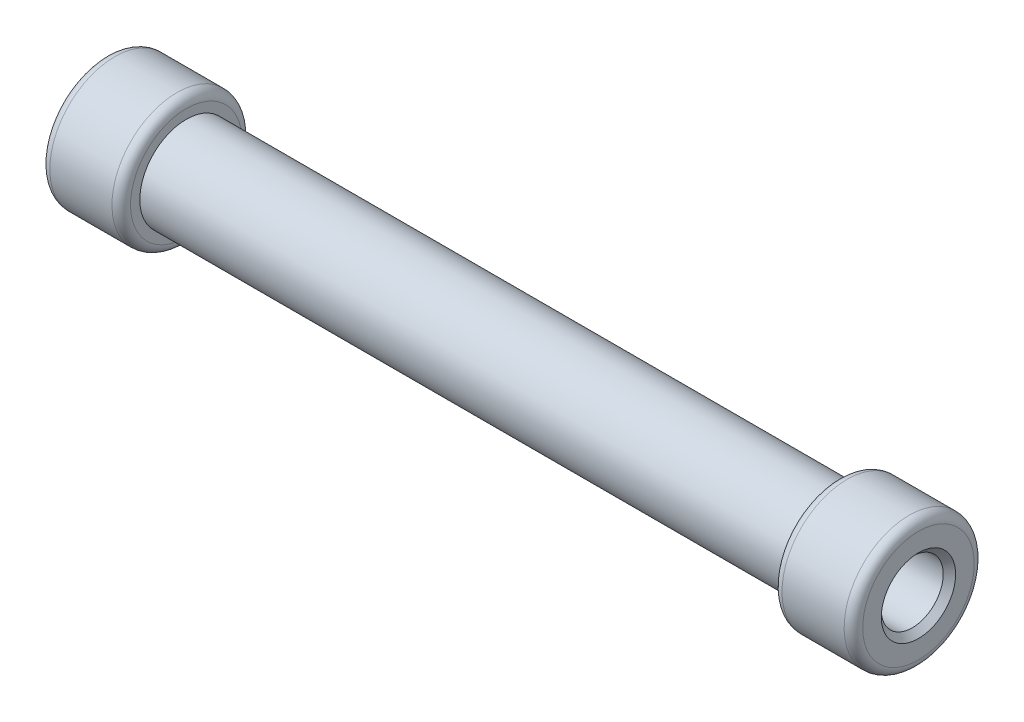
ISO-10303-21;
HEADER;
FILE_DESCRIPTION(('STEP AP214'),'2;1');
FILE_NAME('part.step','',(''),(''),'','','');
FILE_SCHEMA(('AUTOMOTIVE_DESIGN { 1 0 10303 214 1 1 1 1 }'));
ENDSEC;
DATA;
#1=APPLICATION_CONTEXT('core data for automotive mechanical design processes');
#2=APPLICATION_PROTOCOL_DEFINITION('international standard','automotive_design',2000,#1);
#3=PRODUCT_CONTEXT('',#1,'mechanical');
#4=PRODUCT('Part','Part','',(#3));
#5=PRODUCT_RELATED_PRODUCT_CATEGORY('part','',(#4));
#6=PRODUCT_DEFINITION_FORMATION('','',#4);
#7=PRODUCT_DEFINITION_CONTEXT('part definition',#1,'design');
#8=PRODUCT_DEFINITION('design','',#6,#7);
#9=PRODUCT_DEFINITION_SHAPE('','',#8);
#10=(LENGTH_UNIT() NAMED_UNIT(*) SI_UNIT(.MILLI.,.METRE.));
#11=(NAMED_UNIT(*) PLANE_ANGLE_UNIT() SI_UNIT($,.RADIAN.));
#12=(NAMED_UNIT(*) SI_UNIT($,.STERADIAN.) SOLID_ANGLE_UNIT());
#13=UNCERTAINTY_MEASURE_WITH_UNIT(LENGTH_MEASURE(1.E-05),#10,'distance_accuracy_value','');
#14=(GEOMETRIC_REPRESENTATION_CONTEXT(3) GLOBAL_UNCERTAINTY_ASSIGNED_CONTEXT((#13)) GLOBAL_UNIT_ASSIGNED_CONTEXT((#10,
#11,#12)) REPRESENTATION_CONTEXT('',''));
#15=CARTESIAN_POINT('',(0.,0.,0.));
#16=DIRECTION('',(0.,0.,1.));
#17=DIRECTION('',(1.,0.,0.));
#18=AXIS2_PLACEMENT_3D('',#15,#16,#17);
#19=CARTESIAN_POINT('',(56.1,0.,5.333333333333));
#20=DIRECTION('',(-1.,0.,0.));
#21=DIRECTION('',(0.,-1.,0.));
#22=AXIS2_PLACEMENT_3D('',#19,#20,#21);
#23=PLANE('',#22);
#24=CARTESIAN_POINT('',(56.1,0.,0.));
#25=DIRECTION('',(1.,0.,0.));
#26=DIRECTION('',(0.,1.,0.));
#27=AXIS2_PLACEMENT_3D('',#24,#25,#26);
#28=CIRCLE('',#27,5.33333333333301);
#29=CARTESIAN_POINT('',(56.1,5.33333333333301,0.));
#30=VERTEX_POINT('',#29);
#31=EDGE_CURVE('E65',#30,#30,#28,.T.);
#32=ORIENTED_EDGE('',*,*,#31,.T.);
#33=EDGE_LOOP('',(#32));
#34=FACE_BOUND('',#33,.T.);
#35=ADVANCED_FACE('F12',(#34),#23,.F.);
#36=CARTESIAN_POINT('',(70.,0.,0.));
#37=DIRECTION('',(1.,0.,0.));
#38=DIRECTION('',(0.,1.,0.));
#39=AXIS2_PLACEMENT_3D('',#36,#37,#38);
#40=CYLINDRICAL_SURFACE('',#39,5.33333333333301);
#41=ORIENTED_EDGE('',*,*,#31,.F.);
#42=EDGE_LOOP('',(#41));
#43=FACE_BOUND('',#42,.T.);
#44=CARTESIAN_POINT('',(68.93333333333,0.,0.));
#45=DIRECTION('',(1.,0.,0.));
#46=DIRECTION('',(0.,1.,0.));
#47=AXIS2_PLACEMENT_3D('',#44,#45,#46);
#48=CIRCLE('',#47,5.33333333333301);
#49=CARTESIAN_POINT('',(68.93333333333,5.33333333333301,0.));
#50=VERTEX_POINT('',#49);
#51=EDGE_CURVE('E62',#50,#50,#48,.T.);
#52=ORIENTED_EDGE('',*,*,#51,.T.);
#53=EDGE_LOOP('',(#52));
#54=FACE_BOUND('',#53,.T.);
#55=ADVANCED_FACE('F70',(#43,#54),#40,.F.);
#56=CARTESIAN_POINT('',(70.,0.,0.));
#57=DIRECTION('',(1.,0.,0.));
#58=DIRECTION('',(0.,1.,0.));
#59=AXIS2_PLACEMENT_3D('',#56,#57,#58);
#60=CONICAL_SURFACE('',#59,6.4,0.785398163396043);
#61=ORIENTED_EDGE('',*,*,#51,.F.);
#62=EDGE_LOOP('',(#61));
#63=FACE_BOUND('',#62,.T.);
#64=CARTESIAN_POINT('',(70.,0.,0.));
#65=DIRECTION('',(1.,0.,0.));
#66=DIRECTION('',(0.,1.,0.));
#67=AXIS2_PLACEMENT_3D('',#64,#65,#66);
#68=CIRCLE('',#67,6.4);
#69=CARTESIAN_POINT('',(70.,6.4,0.));
#70=VERTEX_POINT('',#69);
#71=EDGE_CURVE('E59',#70,#70,#68,.T.);
#72=ORIENTED_EDGE('',*,*,#71,.T.);
#73=EDGE_LOOP('',(#72));
#74=FACE_BOUND('',#73,.T.);
#75=ADVANCED_FACE('F73',(#63,#74),#60,.F.);
#76=CARTESIAN_POINT('',(70.,0.,9.6));
#77=DIRECTION('',(-1.,0.,0.));
#78=DIRECTION('',(0.,-1.,0.));
#79=AXIS2_PLACEMENT_3D('',#76,#77,#78);
#80=PLANE('',#79);
#81=ORIENTED_EDGE('',*,*,#71,.F.);
#82=EDGE_LOOP('',(#81));
#83=FACE_BOUND('',#82,.T.);
#84=CARTESIAN_POINT('',(70.,0.,0.));
#85=DIRECTION('',(1.,0.,0.));
#86=DIRECTION('',(0.,1.,0.));
#87=AXIS2_PLACEMENT_3D('',#84,#85,#86);
#88=CIRCLE('',#87,9.60000000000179);
#89=CARTESIAN_POINT('',(70.,9.60000000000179,0.));
#90=VERTEX_POINT('',#89);
#91=EDGE_CURVE('E56',#90,#90,#88,.T.);
#92=ORIENTED_EDGE('',*,*,#91,.T.);
#93=EDGE_LOOP('',(#92));
#94=FACE_BOUND('',#93,.T.);
#95=ADVANCED_FACE('F79',(#83,#94),#80,.F.);
#96=CARTESIAN_POINT('',(68.4000000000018,0.,0.));
#97=DIRECTION('',(1.,0.,0.));
#98=DIRECTION('',(0.,1.,0.));
#99=AXIS2_PLACEMENT_3D('',#96,#97,#98);
#100=TOROIDAL_SURFACE('',#99,9.60000000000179,1.59999999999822);
#101=CARTESIAN_POINT('',(68.4,0.,0.));
#102=DIRECTION('',(1.,0.,0.));
#103=DIRECTION('',(0.,1.,0.));
#104=AXIS2_PLACEMENT_3D('',#101,#102,#103);
#105=CIRCLE('',#104,11.2);
#106=CARTESIAN_POINT('',(68.4,11.2,0.));
#107=VERTEX_POINT('',#106);
#108=EDGE_CURVE('E53',#107,#107,#105,.T.);
#109=ORIENTED_EDGE('',*,*,#108,.T.);
#110=EDGE_LOOP('',(#109));
#111=FACE_BOUND('',#110,.T.);
#112=ORIENTED_EDGE('',*,*,#91,.F.);
#113=EDGE_LOOP('',(#112));
#114=FACE_BOUND('',#113,.T.);
#115=ADVANCED_FACE('F85',(#111,#114),#100,.T.);
#116=CARTESIAN_POINT('',(70.,0.,0.));
#117=DIRECTION('',(1.,0.,0.));
#118=DIRECTION('',(0.,1.,0.));
#119=AXIS2_PLACEMENT_3D('',#116,#117,#118);
#120=CYLINDRICAL_SURFACE('',#119,11.2);
#121=ORIENTED_EDGE('',*,*,#108,.F.);
#122=EDGE_LOOP('',(#121));
#123=FACE_BOUND('',#122,.T.);
#124=CARTESIAN_POINT('',(57.7000000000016,0.,0.));
#125=DIRECTION('',(1.,0.,0.));
#126=DIRECTION('',(0.,1.,0.));
#127=AXIS2_PLACEMENT_3D('',#124,#125,#126);
#128=CIRCLE('',#127,11.2);
#129=CARTESIAN_POINT('',(57.7000000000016,11.2,0.));
#130=VERTEX_POINT('',#129);
#131=EDGE_CURVE('E50',#130,#130,#128,.T.);
#132=ORIENTED_EDGE('',*,*,#131,.T.);
#133=EDGE_LOOP('',(#132));
#134=FACE_BOUND('',#133,.T.);
#135=ADVANCED_FACE('F90',(#123,#134),#120,.T.);
#136=CARTESIAN_POINT('',(57.7000000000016,0.,0.));
#137=DIRECTION('',(1.,0.,0.));
#138=DIRECTION('',(0.,1.,0.));
#139=AXIS2_PLACEMENT_3D('',#136,#137,#138);
#140=TOROIDAL_SURFACE('',#139,9.5999999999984,1.6000000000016);
#141=CARTESIAN_POINT('',(56.1,0.,0.));
#142=DIRECTION('',(1.,0.,0.));
#143=DIRECTION('',(0.,1.,0.));
#144=AXIS2_PLACEMENT_3D('',#141,#142,#143);
#145=CIRCLE('',#144,9.6);
#146=CARTESIAN_POINT('',(56.1,9.6,0.));
#147=VERTEX_POINT('',#146);
#148=EDGE_CURVE('E47',#147,#147,#145,.T.);
#149=ORIENTED_EDGE('',*,*,#148,.T.);
#150=EDGE_LOOP('',(#149));
#151=FACE_BOUND('',#150,.T.);
#152=ORIENTED_EDGE('',*,*,#131,.F.);
#153=EDGE_LOOP('',(#152));
#154=FACE_BOUND('',#153,.T.);
#155=ADVANCED_FACE('F98',(#151,#154),#140,.T.);
#156=CARTESIAN_POINT('',(56.1,0.,8.));
#157=DIRECTION('',(1.,0.,0.));
#158=DIRECTION('',(0.,1.,0.));
#159=AXIS2_PLACEMENT_3D('',#156,#157,#158);
#160=PLANE('',#159);
#161=ORIENTED_EDGE('',*,*,#148,.F.);
#162=EDGE_LOOP('',(#161));
#163=FACE_BOUND('',#162,.T.);
#164=CARTESIAN_POINT('',(56.1,0.,0.));
#165=DIRECTION('',(1.,0.,0.));
#166=DIRECTION('',(0.,1.,0.));
#167=AXIS2_PLACEMENT_3D('',#164,#165,#166);
#168=CIRCLE('',#167,8.);
#169=CARTESIAN_POINT('',(56.1,8.,0.));
#170=VERTEX_POINT('',#169);
#171=EDGE_CURVE('E44',#170,#170,#168,.T.);
#172=ORIENTED_EDGE('',*,*,#171,.T.);
#173=EDGE_LOOP('',(#172));
#174=FACE_BOUND('',#173,.T.);
#175=ADVANCED_FACE('F145',(#163,#174),#160,.F.);
#176=CARTESIAN_POINT('',(-56.1,0.,0.));
#177=DIRECTION('',(1.,0.,0.));
#178=DIRECTION('',(0.,1.,0.));
#179=AXIS2_PLACEMENT_3D('',#176,#177,#178);
#180=PLANE('',#179);
#181=CARTESIAN_POINT('',(-56.1,0.,0.));
#182=DIRECTION('',(1.,0.,0.));
#183=DIRECTION('',(0.,1.,0.));
#184=AXIS2_PLACEMENT_3D('',#181,#182,#183);
#185=CIRCLE('',#184,5.33333333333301);
#186=CARTESIAN_POINT('',(-56.1,5.33333333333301,0.));
#187=VERTEX_POINT('',#186);
#188=EDGE_CURVE('E8',#187,#187,#185,.T.);
#189=ORIENTED_EDGE('',*,*,#188,.F.);
#190=EDGE_LOOP('',(#189));
#191=FACE_BOUND('',#190,.T.);
#192=ADVANCED_FACE('F14',(#191),#180,.F.);
#193=CARTESIAN_POINT('',(70.,0.,0.));
#194=DIRECTION('',(1.,0.,0.));
#195=DIRECTION('',(0.,1.,0.));
#196=AXIS2_PLACEMENT_3D('',#193,#194,#195);
#197=CYLINDRICAL_SURFACE('',#196,5.33333333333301);
#198=CARTESIAN_POINT('',(-68.933333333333,0.,0.));
#199=DIRECTION('',(1.,0.,0.));
#200=DIRECTION('',(0.,1.,0.));
#201=AXIS2_PLACEMENT_3D('',#198,#199,#200);
#202=CIRCLE('',#201,5.33333333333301);
#203=CARTESIAN_POINT('',(-68.933333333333,5.33333333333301,0.));
#204=VERTEX_POINT('',#203);
#205=EDGE_CURVE('E19',#204,#204,#202,.T.);
#206=ORIENTED_EDGE('',*,*,#205,.F.);
#207=EDGE_LOOP('',(#206));
#208=FACE_BOUND('',#207,.T.);
#209=ORIENTED_EDGE('',*,*,#188,.T.);
#210=EDGE_LOOP('',(#209));
#211=FACE_BOUND('',#210,.T.);
#212=ADVANCED_FACE('F161',(#208,#211),#197,.F.);
#213=CARTESIAN_POINT('',(-68.933333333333,0.,0.));
#214=DIRECTION('',(-1.,0.,0.));
#215=DIRECTION('',(0.,-1.,0.));
#216=AXIS2_PLACEMENT_3D('',#213,#214,#215);
#217=CONICAL_SURFACE('',#216,5.33333333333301,0.785398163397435);
#218=CARTESIAN_POINT('',(-70.,0.,0.));
#219=DIRECTION('',(1.,0.,0.));
#220=DIRECTION('',(0.,1.,0.));
#221=AXIS2_PLACEMENT_3D('',#218,#219,#220);
#222=CIRCLE('',#221,6.4);
#223=CARTESIAN_POINT('',(-70.,6.4,0.));
#224=VERTEX_POINT('',#223);
#225=EDGE_CURVE('E23',#224,#224,#222,.T.);
#226=ORIENTED_EDGE('',*,*,#225,.F.);
#227=EDGE_LOOP('',(#226));
#228=FACE_BOUND('',#227,.T.);
#229=ORIENTED_EDGE('',*,*,#205,.T.);
#230=EDGE_LOOP('',(#229));
#231=FACE_BOUND('',#230,.T.);
#232=ADVANCED_FACE('F169',(#228,#231),#217,.F.);
#233=CARTESIAN_POINT('',(-70.,0.,6.4));
#234=DIRECTION('',(1.,0.,0.));
#235=DIRECTION('',(0.,1.,0.));
#236=AXIS2_PLACEMENT_3D('',#233,#234,#235);
#237=PLANE('',#236);
#238=CARTESIAN_POINT('',(-70.,0.,0.));
#239=DIRECTION('',(1.,0.,0.));
#240=DIRECTION('',(0.,1.,0.));
#241=AXIS2_PLACEMENT_3D('',#238,#239,#240);
#242=CIRCLE('',#241,9.6);
#243=CARTESIAN_POINT('',(-70.,9.6,0.));
#244=VERTEX_POINT('',#243);
#245=EDGE_CURVE('E27',#244,#244,#242,.T.);
#246=ORIENTED_EDGE('',*,*,#245,.F.);
#247=EDGE_LOOP('',(#246));
#248=FACE_BOUND('',#247,.T.);
#249=ORIENTED_EDGE('',*,*,#225,.T.);
#250=EDGE_LOOP('',(#249));
#251=FACE_BOUND('',#250,.T.);
#252=ADVANCED_FACE('F177',(#248,#251),#237,.F.);
#253=CARTESIAN_POINT('',(-68.3999999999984,0.,0.));
#254=DIRECTION('',(1.,0.,0.));
#255=DIRECTION('',(0.,1.,0.));
#256=AXIS2_PLACEMENT_3D('',#253,#254,#255);
#257=TOROIDAL_SURFACE('',#256,9.59999999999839,1.60000000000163);
#258=ORIENTED_EDGE('',*,*,#245,.T.);
#259=EDGE_LOOP('',(#258));
#260=FACE_BOUND('',#259,.T.);
#261=CARTESIAN_POINT('',(-68.3999999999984,0.,0.));
#262=DIRECTION('',(1.,0.,0.));
#263=DIRECTION('',(0.,1.,0.));
#264=AXIS2_PLACEMENT_3D('',#261,#262,#263);
#265=CIRCLE('',#264,11.2);
#266=CARTESIAN_POINT('',(-68.3999999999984,11.2,0.));
#267=VERTEX_POINT('',#266);
#268=EDGE_CURVE('E32',#267,#267,#265,.T.);
#269=ORIENTED_EDGE('',*,*,#268,.F.);
#270=EDGE_LOOP('',(#269));
#271=FACE_BOUND('',#270,.T.);
#272=ADVANCED_FACE('F186',(#260,#271),#257,.T.);
#273=CARTESIAN_POINT('',(70.,0.,0.));
#274=DIRECTION('',(1.,0.,0.));
#275=DIRECTION('',(0.,1.,0.));
#276=AXIS2_PLACEMENT_3D('',#273,#274,#275);
#277=CYLINDRICAL_SURFACE('',#276,11.2);
#278=CARTESIAN_POINT('',(-57.7,0.,0.));
#279=DIRECTION('',(1.,0.,0.));
#280=DIRECTION('',(0.,1.,0.));
#281=AXIS2_PLACEMENT_3D('',#278,#279,#280);
#282=CIRCLE('',#281,11.2);
#283=CARTESIAN_POINT('',(-57.7,11.2,0.));
#284=VERTEX_POINT('',#283);
#285=EDGE_CURVE('E35',#284,#284,#282,.T.);
#286=ORIENTED_EDGE('',*,*,#285,.F.);
#287=EDGE_LOOP('',(#286));
#288=FACE_BOUND('',#287,.T.);
#289=ORIENTED_EDGE('',*,*,#268,.T.);
#290=EDGE_LOOP('',(#289));
#291=FACE_BOUND('',#290,.T.);
#292=ADVANCED_FACE('F195',(#288,#291),#277,.T.);
#293=CARTESIAN_POINT('',(-57.7000000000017,0.,0.));
#294=DIRECTION('',(1.,0.,0.));
#295=DIRECTION('',(0.,1.,0.));
#296=AXIS2_PLACEMENT_3D('',#293,#294,#295);
#297=TOROIDAL_SURFACE('',#296,9.59999999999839,1.60000000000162);
#298=ORIENTED_EDGE('',*,*,#285,.T.);
#299=EDGE_LOOP('',(#298));
#300=FACE_BOUND('',#299,.T.);
#301=CARTESIAN_POINT('',(-56.1,0.,0.));
#302=DIRECTION('',(1.,0.,0.));
#303=DIRECTION('',(0.,1.,0.));
#304=AXIS2_PLACEMENT_3D('',#301,#302,#303);
#305=CIRCLE('',#304,9.60000002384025);
#306=CARTESIAN_POINT('',(-56.1,9.60000002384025,0.));
#307=VERTEX_POINT('',#306);
#308=EDGE_CURVE('E38',#307,#307,#305,.T.);
#309=ORIENTED_EDGE('',*,*,#308,.F.);
#310=EDGE_LOOP('',(#309));
#311=FACE_BOUND('',#310,.T.);
#312=ADVANCED_FACE('F204',(#300,#311),#297,.T.);
#313=CARTESIAN_POINT('',(-56.1,0.,9.6));
#314=DIRECTION('',(-1.,0.,0.));
#315=DIRECTION('',(0.,-1.,0.));
#316=AXIS2_PLACEMENT_3D('',#313,#314,#315);
#317=PLANE('',#316);
#318=CARTESIAN_POINT('',(-56.1,0.,0.));
#319=DIRECTION('',(1.,0.,0.));
#320=DIRECTION('',(0.,1.,0.));
#321=AXIS2_PLACEMENT_3D('',#318,#319,#320);
#322=CIRCLE('',#321,8.);
#323=CARTESIAN_POINT('',(-56.1,8.,0.));
#324=VERTEX_POINT('',#323);
#325=EDGE_CURVE('E41',#324,#324,#322,.T.);
#326=ORIENTED_EDGE('',*,*,#325,.F.);
#327=EDGE_LOOP('',(#326));
#328=FACE_BOUND('',#327,.T.);
#329=ORIENTED_EDGE('',*,*,#308,.T.);
#330=EDGE_LOOP('',(#329));
#331=FACE_BOUND('',#330,.T.);
#332=ADVANCED_FACE('F213',(#328,#331),#317,.F.);
#333=CARTESIAN_POINT('',(70.,0.,0.));
#334=DIRECTION('',(1.,0.,0.));
#335=DIRECTION('',(0.,1.,0.));
#336=AXIS2_PLACEMENT_3D('',#333,#334,#335);
#337=CYLINDRICAL_SURFACE('',#336,8.);
#338=ORIENTED_EDGE('',*,*,#325,.T.);
#339=EDGE_LOOP('',(#338));
#340=FACE_BOUND('',#339,.T.);
#341=ORIENTED_EDGE('',*,*,#171,.F.);
#342=EDGE_LOOP('',(#341));
#343=FACE_BOUND('',#342,.T.);
#344=ADVANCED_FACE('F222',(#340,#343),#337,.T.);
#345=CLOSED_SHELL('',(#35,#55,#75,#95,#115,#135,#155,#175,#192,#212,#232,#252,#272,#292,#312,
#332,#344));
#346=MANIFOLD_SOLID_BREP('B1',#345);
#347=ADVANCED_BREP_SHAPE_REPRESENTATION('',(#18,#346),#14);
#348=SHAPE_DEFINITION_REPRESENTATION(#9,#347);
ENDSEC;
END-ISO-10303-21;
